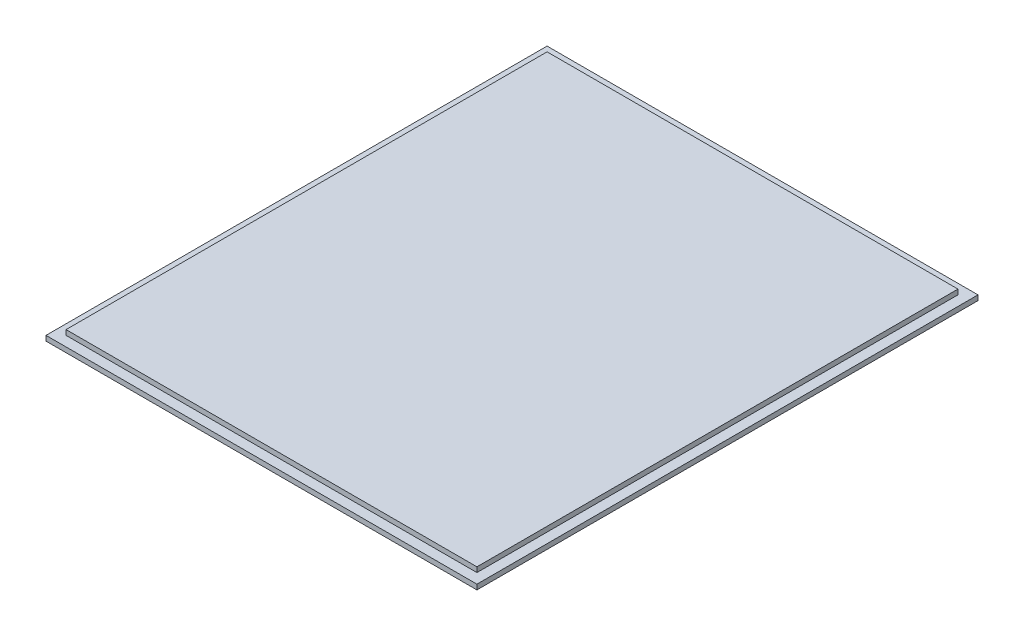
from build123d import *

# Parameters (mm, degrees)
SKETCH1_W           = 273.05
SKETCH1_H           = 317.5
BOSS_EXTRUDE1_DEPTH = 6.35
SKETCH2_OUTSIDE_W   = 358.812
SKETCH2_OUTSIDE_H   = 403.262
SKETCH2_OUTSIDE_W_2 = 260.35
SKETCH2_OUTSIDE_H_2 = 304.8
CUT_EXTRUDE1_DEPTH  = 3.175


with BuildPart() as part:
    # Sketch1 → Boss-Extrude1 (new body)
    with BuildSketch(Plane(origin=(0, 0, 0), x_dir=(1, 0, 0), z_dir=(0, 1, 0))):
        Rectangle(SKETCH1_W, SKETCH1_H)
    extrude(amount=BOSS_EXTRUDE1_DEPTH)

    # Sketch2 outside → Cut-Extrude1 (cut)
    with BuildSketch(Plane(origin=(0, 6.35, 0), x_dir=(1, 0, 0), z_dir=(0, 1, 0))):
        Rectangle(SKETCH2_OUTSIDE_W, SKETCH2_OUTSIDE_H)
        Rectangle(SKETCH2_OUTSIDE_W_2, SKETCH2_OUTSIDE_H_2, mode=Mode.SUBTRACT)
    extrude(amount=-CUT_EXTRUDE1_DEPTH, mode=Mode.SUBTRACT)


solid = part.part
